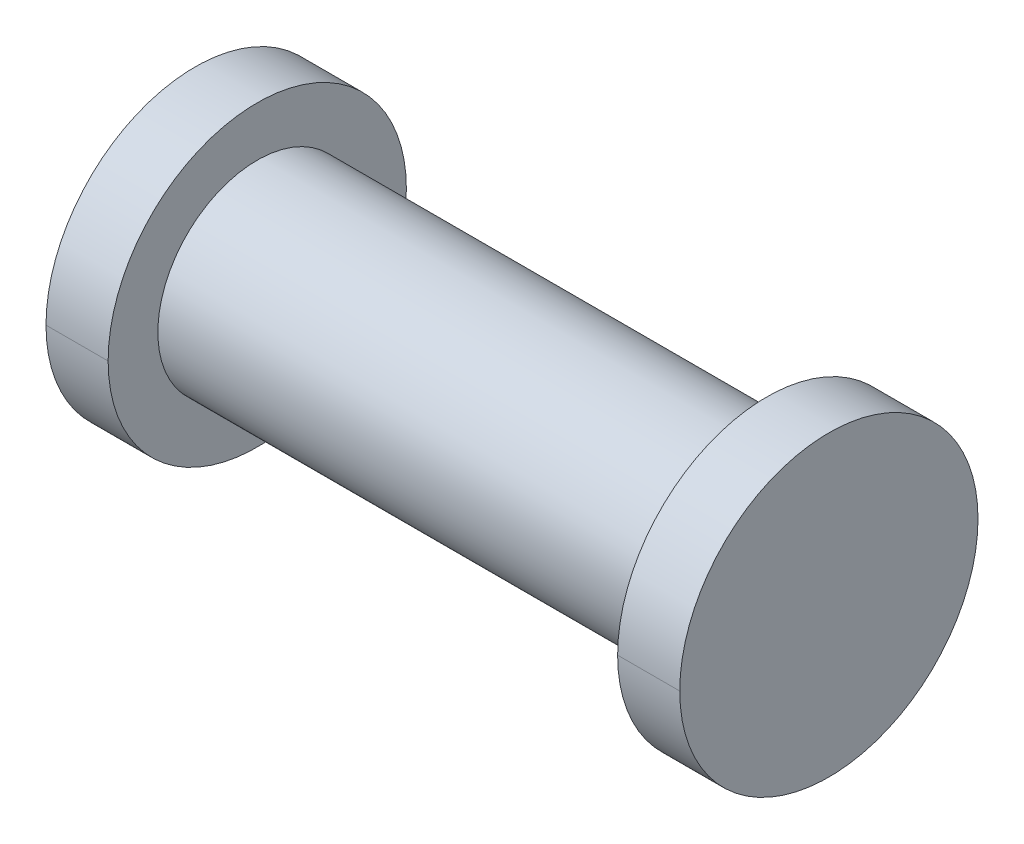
from build123d import *


with BuildPart() as part:
    # Esquisse1 → R_volution1 (revolve)
    with BuildSketch(Plane(origin=(0, 0, 0), x_dir=(1, 0, 0), z_dir=(0, 1, 0))):
        Polygon((0, 0), (0, 12), (-5, 12), (-5, 8), (-46, 8), (-46, 12), (-51, 12), (-51, 0), align=None)
    revolve(axis=Axis((0, 0, 0), (-1, 0, 0)))


solid = part.part
